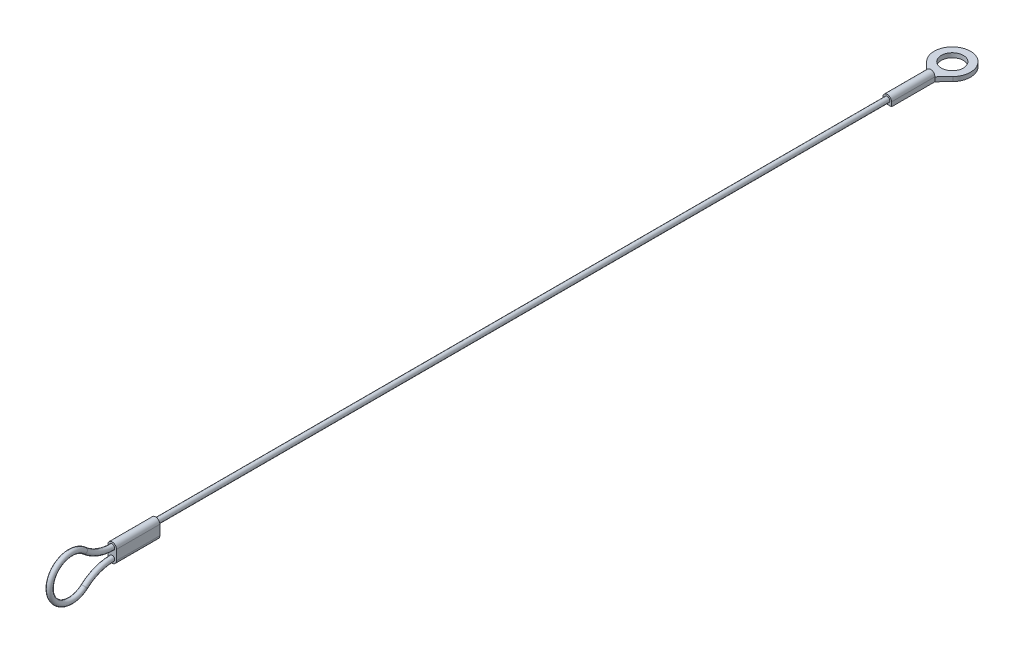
ISO-10303-21;
HEADER;
FILE_DESCRIPTION(('STEP AP214'),'2;1');
FILE_NAME('part.step','',(''),(''),'','','');
FILE_SCHEMA(('AUTOMOTIVE_DESIGN { 1 0 10303 214 1 1 1 1 }'));
ENDSEC;
DATA;
#1=APPLICATION_CONTEXT('core data for automotive mechanical design processes');
#2=APPLICATION_PROTOCOL_DEFINITION('international standard','automotive_design',2000,#1);
#3=PRODUCT_CONTEXT('',#1,'mechanical');
#4=PRODUCT('Part','Part','',(#3));
#5=PRODUCT_RELATED_PRODUCT_CATEGORY('part','',(#4));
#6=PRODUCT_DEFINITION_FORMATION('','',#4);
#7=PRODUCT_DEFINITION_CONTEXT('part definition',#1,'design');
#8=PRODUCT_DEFINITION('design','',#6,#7);
#9=PRODUCT_DEFINITION_SHAPE('','',#8);
#10=(LENGTH_UNIT() NAMED_UNIT(*) SI_UNIT(.MILLI.,.METRE.));
#11=(NAMED_UNIT(*) PLANE_ANGLE_UNIT() SI_UNIT($,.RADIAN.));
#12=(NAMED_UNIT(*) SI_UNIT($,.STERADIAN.) SOLID_ANGLE_UNIT());
#13=UNCERTAINTY_MEASURE_WITH_UNIT(LENGTH_MEASURE(1.E-05),#10,'distance_accuracy_value','');
#14=(GEOMETRIC_REPRESENTATION_CONTEXT(3) GLOBAL_UNCERTAINTY_ASSIGNED_CONTEXT((#13)) GLOBAL_UNIT_ASSIGNED_CONTEXT((#10,
#11,#12)) REPRESENTATION_CONTEXT('',''));
#15=CARTESIAN_POINT('',(0.,0.,0.));
#16=DIRECTION('',(0.,0.,1.));
#17=DIRECTION('',(1.,0.,0.));
#18=AXIS2_PLACEMENT_3D('',#15,#16,#17);
#19=CARTESIAN_POINT('',(0.,0.,-10.));
#20=DIRECTION('',(0.,0.,-1.));
#21=DIRECTION('',(-1.,0.,0.));
#22=AXIS2_PLACEMENT_3D('',#19,#20,#21);
#23=PLANE('',#22);
#24=CARTESIAN_POINT('',(0.,0.,-10.));
#25=DIRECTION('',(0.,0.,-1.));
#26=DIRECTION('',(-1.,0.,0.));
#27=AXIS2_PLACEMENT_3D('',#24,#25,#26);
#28=CIRCLE('',#27,0.995);
#29=CARTESIAN_POINT('',(-0.995,0.00749999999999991,-10.));
#30=VERTEX_POINT('',#29);
#31=CARTESIAN_POINT('',(0.995,0.00749999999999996,-10.));
#32=VERTEX_POINT('',#31);
#33=EDGE_CURVE('E177',#30,#32,#28,.T.);
#34=ORIENTED_EDGE('',*,*,#33,.T.);
#35=DIRECTION('',(-1.,0.,0.));
#36=VECTOR('',#35,1.);
#37=CARTESIAN_POINT('',(-0.995,0.015,-10.));
#38=LINE('',#37,#36);
#39=EDGE_CURVE('E135',#32,#30,#38,.T.);
#40=ORIENTED_EDGE('',*,*,#39,.T.);
#41=EDGE_LOOP('',(#34,#40));
#42=FACE_BOUND('',#41,.T.);
#43=ADVANCED_FACE('F39',(#42),#23,.T.);
#44=CARTESIAN_POINT('',(0.,0.,178.6));
#45=DIRECTION('',(0.,0.,-1.));
#46=DIRECTION('',(-1.,0.,0.));
#47=AXIS2_PLACEMENT_3D('',#44,#45,#46);
#48=CYLINDRICAL_SURFACE('',#47,0.595);
#49=CARTESIAN_POINT('',(0.,0.,168.6));
#50=DIRECTION('',(0.,0.,-1.));
#51=DIRECTION('',(0.,1.,0.));
#52=AXIS2_PLACEMENT_3D('',#49,#50,#51);
#53=CIRCLE('',#52,0.595);
#54=CARTESIAN_POINT('',(0.,0.595,168.6));
#55=VERTEX_POINT('',#54);
#56=EDGE_CURVE('E223',#55,#55,#53,.T.);
#57=ORIENTED_EDGE('',*,*,#56,.T.);
#58=EDGE_LOOP('',(#57));
#59=FACE_BOUND('',#58,.T.);
#60=CARTESIAN_POINT('',(0.,0.,0.));
#61=DIRECTION('',(0.,0.,1.));
#62=DIRECTION('',(1.,0.,0.));
#63=AXIS2_PLACEMENT_3D('',#60,#61,#62);
#64=CIRCLE('',#63,0.595);
#65=CARTESIAN_POINT('',(0.595,0.,0.));
#66=VERTEX_POINT('',#65);
#67=EDGE_CURVE('E200',#66,#66,#64,.T.);
#68=ORIENTED_EDGE('',*,*,#67,.T.);
#69=EDGE_LOOP('',(#68));
#70=FACE_BOUND('',#69,.T.);
#71=ADVANCED_FACE('F41',(#59,#70),#48,.T.);
#72=CARTESIAN_POINT('',(0.,2.43728648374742E-13,168.6));
#73=DIRECTION('',(0.,0.,1.));
#74=DIRECTION('',(0.,-1.,0.));
#75=AXIS2_PLACEMENT_3D('',#72,#73,#74);
#76=CYLINDRICAL_SURFACE('',#75,0.995);
#77=CARTESIAN_POINT('',(0.,2.58184677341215E-13,178.6));
#78=DIRECTION('',(0.,0.,-1.));
#79=DIRECTION('',(0.,1.,0.));
#80=AXIS2_PLACEMENT_3D('',#77,#78,#79);
#81=CIRCLE('',#80,0.995);
#82=CARTESIAN_POINT('',(-0.995,2.5830652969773E-13,178.6));
#83=VERTEX_POINT('',#82);
#84=CARTESIAN_POINT('',(0.995,2.580628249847E-13,178.6));
#85=VERTEX_POINT('',#84);
#86=EDGE_CURVE('E195',#83,#85,#81,.T.);
#87=ORIENTED_EDGE('',*,*,#86,.T.);
#88=DIRECTION('',(0.,0.,1.));
#89=VECTOR('',#88,1.);
#90=CARTESIAN_POINT('',(0.995,2.43606796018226E-13,168.6));
#91=LINE('',#90,#89);
#92=CARTESIAN_POINT('',(0.995,2.43606796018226E-13,168.6));
#93=VERTEX_POINT('',#92);
#94=EDGE_CURVE('E216',#93,#85,#91,.T.);
#95=ORIENTED_EDGE('',*,*,#94,.F.);
#96=CARTESIAN_POINT('',(0.,2.43728648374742E-13,168.6));
#97=DIRECTION('',(0.,0.,-1.));
#98=DIRECTION('',(0.,1.,0.));
#99=AXIS2_PLACEMENT_3D('',#96,#97,#98);
#100=CIRCLE('',#99,0.995);
#101=CARTESIAN_POINT('',(-0.995,2.43850500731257E-13,168.6));
#102=VERTEX_POINT('',#101);
#103=EDGE_CURVE('E184',#102,#93,#100,.T.);
#104=ORIENTED_EDGE('',*,*,#103,.F.);
#105=DIRECTION('',(0.,0.,1.));
#106=VECTOR('',#105,1.);
#107=CARTESIAN_POINT('',(-0.995,2.43850500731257E-13,168.6));
#108=LINE('',#107,#106);
#109=EDGE_CURVE('E194',#102,#83,#108,.T.);
#110=ORIENTED_EDGE('',*,*,#109,.T.);
#111=EDGE_LOOP('',(#87,#95,#104,#110));
#112=FACE_BOUND('',#111,.T.);
#113=ADVANCED_FACE('F418',(#112),#76,.T.);
#114=CARTESIAN_POINT('',(0.995,2.43606796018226E-13,168.6));
#115=DIRECTION('',(-1.,0.,0.));
#116=DIRECTION('',(0.,-1.,0.));
#117=AXIS2_PLACEMENT_3D('',#114,#115,#116);
#118=PLANE('',#117);
#119=DIRECTION('',(0.,-1.,0.));
#120=VECTOR('',#119,1.);
#121=CARTESIAN_POINT('',(0.995,2.580628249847E-13,178.6));
#122=LINE('',#121,#120);
#123=CARTESIAN_POINT('',(0.994999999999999,-2.26625258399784,178.6));
#124=VERTEX_POINT('',#123);
#125=EDGE_CURVE('E199',#85,#124,#122,.T.);
#126=ORIENTED_EDGE('',*,*,#125,.T.);
#127=DIRECTION('',(0.,0.,1.));
#128=VECTOR('',#127,1.);
#129=CARTESIAN_POINT('',(0.994999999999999,-2.26625258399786,168.6));
#130=LINE('',#129,#128);
#131=CARTESIAN_POINT('',(0.994999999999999,-2.26625258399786,168.6));
#132=VERTEX_POINT('',#131);
#133=EDGE_CURVE('E212',#132,#124,#130,.T.);
#134=ORIENTED_EDGE('',*,*,#133,.F.);
#135=DIRECTION('',(0.,-1.,0.));
#136=VECTOR('',#135,1.);
#137=CARTESIAN_POINT('',(0.995,2.43606796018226E-13,168.6));
#138=LINE('',#137,#136);
#139=EDGE_CURVE('E87',#93,#132,#138,.T.);
#140=ORIENTED_EDGE('',*,*,#139,.F.);
#141=ORIENTED_EDGE('',*,*,#94,.T.);
#142=EDGE_LOOP('',(#126,#134,#140,#141));
#143=FACE_BOUND('',#142,.T.);
#144=ADVANCED_FACE('F411',(#143),#118,.F.);
#145=CARTESIAN_POINT('',(0.,-2.26625258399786,168.6));
#146=DIRECTION('',(0.,0.,1.));
#147=DIRECTION('',(0.,-1.,0.));
#148=AXIS2_PLACEMENT_3D('',#145,#146,#147);
#149=CYLINDRICAL_SURFACE('',#148,0.995);
#150=CARTESIAN_POINT('',(0.,-2.26625258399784,178.6));
#151=DIRECTION('',(0.,0.,-1.));
#152=DIRECTION('',(0.,1.,0.));
#153=AXIS2_PLACEMENT_3D('',#150,#151,#152);
#154=CIRCLE('',#153,0.995);
#155=CARTESIAN_POINT('',(-0.995,-2.26625258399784,178.6));
#156=VERTEX_POINT('',#155);
#157=EDGE_CURVE('E203',#124,#156,#154,.T.);
#158=ORIENTED_EDGE('',*,*,#157,.T.);
#159=DIRECTION('',(0.,0.,1.));
#160=VECTOR('',#159,1.);
#161=CARTESIAN_POINT('',(-0.995,-2.26625258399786,168.6));
#162=LINE('',#161,#160);
#163=CARTESIAN_POINT('',(-0.995,-2.26625258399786,168.6));
#164=VERTEX_POINT('',#163);
#165=EDGE_CURVE('E209',#164,#156,#162,.T.);
#166=ORIENTED_EDGE('',*,*,#165,.F.);
#167=CARTESIAN_POINT('',(0.,-2.26625258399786,168.6));
#168=DIRECTION('',(0.,0.,-1.));
#169=DIRECTION('',(0.,1.,0.));
#170=AXIS2_PLACEMENT_3D('',#167,#168,#169);
#171=CIRCLE('',#170,0.995);
#172=EDGE_CURVE('E189',#132,#164,#171,.T.);
#173=ORIENTED_EDGE('',*,*,#172,.F.);
#174=ORIENTED_EDGE('',*,*,#133,.T.);
#175=EDGE_LOOP('',(#158,#166,#173,#174));
#176=FACE_BOUND('',#175,.T.);
#177=ADVANCED_FACE('F405',(#176),#149,.T.);
#178=CARTESIAN_POINT('',(-0.995,2.43850500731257E-13,168.6));
#179=DIRECTION('',(1.,0.,0.));
#180=DIRECTION('',(0.,0.,-1.));
#181=AXIS2_PLACEMENT_3D('',#178,#179,#180);
#182=PLANE('',#181);
#183=DIRECTION('',(0.,1.,0.));
#184=VECTOR('',#183,1.);
#185=CARTESIAN_POINT('',(-0.995,2.5830652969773E-13,178.6));
#186=LINE('',#185,#184);
#187=EDGE_CURVE('E79',#156,#83,#186,.T.);
#188=ORIENTED_EDGE('',*,*,#187,.T.);
#189=ORIENTED_EDGE('',*,*,#109,.F.);
#190=DIRECTION('',(0.,1.,0.));
#191=VECTOR('',#190,1.);
#192=CARTESIAN_POINT('',(-0.995,2.43850500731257E-13,168.6));
#193=LINE('',#192,#191);
#194=EDGE_CURVE('E59',#164,#102,#193,.T.);
#195=ORIENTED_EDGE('',*,*,#194,.F.);
#196=ORIENTED_EDGE('',*,*,#165,.T.);
#197=EDGE_LOOP('',(#188,#189,#195,#196));
#198=FACE_BOUND('',#197,.T.);
#199=ADVANCED_FACE('F399',(#198),#182,.F.);
#200=CARTESIAN_POINT('',(0.,2.43728648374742E-13,168.6));
#201=DIRECTION('',(0.,0.,-1.));
#202=DIRECTION('',(0.,1.,0.));
#203=AXIS2_PLACEMENT_3D('',#200,#201,#202);
#204=PLANE('',#203);
#205=ORIENTED_EDGE('',*,*,#56,.F.);
#206=EDGE_LOOP('',(#205));
#207=FACE_BOUND('',#206,.T.);
#208=ORIENTED_EDGE('',*,*,#103,.T.);
#209=ORIENTED_EDGE('',*,*,#139,.T.);
#210=ORIENTED_EDGE('',*,*,#172,.T.);
#211=ORIENTED_EDGE('',*,*,#194,.T.);
#212=EDGE_LOOP('',(#208,#209,#210,#211));
#213=FACE_BOUND('',#212,.T.);
#214=ADVANCED_FACE('F277',(#207,#213),#204,.T.);
#215=CARTESIAN_POINT('',(0.,2.58184677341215E-13,178.6));
#216=DIRECTION('',(0.,0.,-1.));
#217=DIRECTION('',(0.,1.,0.));
#218=AXIS2_PLACEMENT_3D('',#215,#216,#217);
#219=PLANE('',#218);
#220=CARTESIAN_POINT('',(0.,-2.26625258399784,178.6));
#221=DIRECTION('',(0.,0.,-1.));
#222=DIRECTION('',(1.,0.,0.));
#223=AXIS2_PLACEMENT_3D('',#220,#221,#222);
#224=CIRCLE('',#223,0.595);
#225=CARTESIAN_POINT('',(0.,-1.67125258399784,178.6));
#226=VERTEX_POINT('',#225);
#227=EDGE_CURVE('E224',#226,#226,#224,.T.);
#228=ORIENTED_EDGE('',*,*,#227,.T.);
#229=EDGE_LOOP('',(#228));
#230=FACE_BOUND('',#229,.T.);
#231=CARTESIAN_POINT('',(0.,0.,178.6));
#232=DIRECTION('',(0.,0.,-1.));
#233=DIRECTION('',(0.,1.,0.));
#234=AXIS2_PLACEMENT_3D('',#231,#232,#233);
#235=CIRCLE('',#234,0.595);
#236=CARTESIAN_POINT('',(0.,-0.595000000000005,178.6));
#237=VERTEX_POINT('',#236);
#238=EDGE_CURVE('E219',#237,#237,#235,.T.);
#239=ORIENTED_EDGE('',*,*,#238,.T.);
#240=EDGE_LOOP('',(#239));
#241=FACE_BOUND('',#240,.T.);
#242=ORIENTED_EDGE('',*,*,#86,.F.);
#243=ORIENTED_EDGE('',*,*,#187,.F.);
#244=ORIENTED_EDGE('',*,*,#157,.F.);
#245=ORIENTED_EDGE('',*,*,#125,.F.);
#246=EDGE_LOOP('',(#242,#243,#244,#245));
#247=FACE_BOUND('',#246,.T.);
#248=ADVANCED_FACE('F387',(#230,#241,#247),#219,.F.);
#249=CARTESIAN_POINT('',(0.,-11.8662525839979,178.6));
#250=DIRECTION('',(1.,0.,0.));
#251=DIRECTION('',(0.,0.,-1.));
#252=AXIS2_PLACEMENT_3D('',#249,#250,#251);
#253=TOROIDAL_SURFACE('',#252,9.60000000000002,0.595);
#254=CARTESIAN_POINT('',(0.,-4.71083505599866,185.));
#255=DIRECTION('',(0.,0.666666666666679,-0.745355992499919));
#256=DIRECTION('',(1.,0.,0.));
#257=AXIS2_PLACEMENT_3D('',#254,#255,#256);
#258=CIRCLE('',#257,0.595);
#259=CARTESIAN_POINT('',(0.,-4.26734824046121,185.396666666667));
#260=VERTEX_POINT('',#259);
#261=EDGE_CURVE('E50',#260,#260,#258,.T.);
#262=CARTESIAN_POINT('',(0.,-11.8662525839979,178.6));
#263=DIRECTION('',(1.,0.,0.));
#264=DIRECTION('',(0.,0.,-1.));
#265=AXIS2_PLACEMENT_3D('',#262,#263,#264);
#266=CIRCLE('',#265,10.195);
#267=EDGE_CURVE('',#226,#260,#266,.T.);
#268=ORIENTED_EDGE('',*,*,#227,.F.);
#269=ORIENTED_EDGE('',*,*,#261,.T.);
#270=ORIENTED_EDGE('',*,*,#267,.T.);
#271=ORIENTED_EDGE('',*,*,#267,.F.);
#272=EDGE_LOOP('',(#268,#270,#269,#271));
#273=FACE_BOUND('',#272,.T.);
#274=ADVANCED_FACE('F380',(#273),#253,.T.);
#275=CARTESIAN_POINT('',(0.,-1.13312629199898,188.2));
#276=DIRECTION('',(-1.,0.,0.));
#277=DIRECTION('',(0.,0.,1.));
#278=AXIS2_PLACEMENT_3D('',#275,#276,#277);
#279=TOROIDAL_SURFACE('',#278,4.80000000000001,0.595);
#280=CARTESIAN_POINT('',(0.,2.44458247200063,185.));
#281=DIRECTION('',(0.,0.666666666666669,0.745355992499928));
#282=DIRECTION('',(1.,0.,0.));
#283=AXIS2_PLACEMENT_3D('',#280,#281,#282);
#284=CIRCLE('',#283,0.595);
#285=CARTESIAN_POINT('',(0.,2.00109565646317,185.396666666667));
#286=VERTEX_POINT('',#285);
#287=EDGE_CURVE('E11',#286,#286,#284,.T.);
#288=ORIENTED_EDGE('',*,*,#287,.T.);
#289=EDGE_LOOP('',(#288));
#290=FACE_BOUND('',#289,.T.);
#291=ORIENTED_EDGE('',*,*,#261,.F.);
#292=EDGE_LOOP('',(#291));
#293=FACE_BOUND('',#292,.T.);
#294=ADVANCED_FACE('F374',(#290,#293),#279,.T.);
#295=CARTESIAN_POINT('',(0.,9.6,178.6));
#296=DIRECTION('',(1.,0.,0.));
#297=DIRECTION('',(0.,0.,-1.));
#298=AXIS2_PLACEMENT_3D('',#295,#296,#297);
#299=TOROIDAL_SURFACE('',#298,9.6,0.595);
#300=CARTESIAN_POINT('',(0.,9.6,178.6));
#301=DIRECTION('',(1.,0.,0.));
#302=DIRECTION('',(0.,0.,-1.));
#303=AXIS2_PLACEMENT_3D('',#300,#301,#302);
#304=CIRCLE('',#303,10.195);
#305=EDGE_CURVE('',#286,#237,#304,.T.);
#306=ORIENTED_EDGE('',*,*,#287,.F.);
#307=ORIENTED_EDGE('',*,*,#238,.F.);
#308=ORIENTED_EDGE('',*,*,#305,.T.);
#309=ORIENTED_EDGE('',*,*,#305,.F.);
#310=EDGE_LOOP('',(#306,#308,#307,#309));
#311=FACE_BOUND('',#310,.T.);
#312=ADVANCED_FACE('F275',(#311),#299,.T.);
#313=CARTESIAN_POINT('',(0.,0.,-10.));
#314=DIRECTION('',(0.,0.,1.));
#315=DIRECTION('',(1.,0.,0.));
#316=AXIS2_PLACEMENT_3D('',#313,#314,#315);
#317=CYLINDRICAL_SURFACE('',#316,0.995);
#318=CARTESIAN_POINT('',(0.,0.,0.));
#319=DIRECTION('',(0.,0.,-1.));
#320=DIRECTION('',(-1.,0.,0.));
#321=AXIS2_PLACEMENT_3D('',#318,#319,#320);
#322=CIRCLE('',#321,0.995);
#323=CARTESIAN_POINT('',(-0.995,0.,0.));
#324=VERTEX_POINT('',#323);
#325=CARTESIAN_POINT('',(0.995,0.,0.));
#326=VERTEX_POINT('',#325);
#327=EDGE_CURVE('E164',#324,#326,#322,.T.);
#328=ORIENTED_EDGE('',*,*,#327,.T.);
#329=DIRECTION('',(0.,0.,1.));
#330=VECTOR('',#329,1.);
#331=CARTESIAN_POINT('',(0.995,0.,-10.));
#332=LINE('',#331,#330);
#333=EDGE_CURVE('E234',#32,#326,#332,.T.);
#334=ORIENTED_EDGE('',*,*,#333,.F.);
#335=ORIENTED_EDGE('',*,*,#33,.F.);
#336=DIRECTION('',(0.,0.,1.));
#337=VECTOR('',#336,1.);
#338=CARTESIAN_POINT('',(-0.995,0.,-10.));
#339=LINE('',#338,#337);
#340=EDGE_CURVE('E183',#30,#324,#339,.T.);
#341=ORIENTED_EDGE('',*,*,#340,.T.);
#342=EDGE_LOOP('',(#328,#334,#335,#341));
#343=FACE_BOUND('',#342,.T.);
#344=ADVANCED_FACE('F270',(#343),#317,.T.);
#345=CARTESIAN_POINT('',(0.995,0.,-10.));
#346=DIRECTION('',(-1.,0.,0.));
#347=DIRECTION('',(0.,-1.,0.));
#348=AXIS2_PLACEMENT_3D('',#345,#346,#347);
#349=PLANE('',#348);
#350=DIRECTION('',(0.,-1.,0.));
#351=VECTOR('',#350,1.);
#352=CARTESIAN_POINT('',(0.995,0.,0.));
#353=LINE('',#352,#351);
#354=CARTESIAN_POINT('',(0.995,-0.995,0.));
#355=VERTEX_POINT('',#354);
#356=EDGE_CURVE('E167',#326,#355,#353,.T.);
#357=ORIENTED_EDGE('',*,*,#356,.T.);
#358=DIRECTION('',(0.,0.,1.));
#359=VECTOR('',#358,1.);
#360=CARTESIAN_POINT('',(0.995,-0.995,-10.));
#361=LINE('',#360,#359);
#362=CARTESIAN_POINT('',(0.995,-0.995,-10.));
#363=VERTEX_POINT('',#362);
#364=EDGE_CURVE('E182',#363,#355,#361,.T.);
#365=ORIENTED_EDGE('',*,*,#364,.F.);
#366=DIRECTION('',(0.,-1.,0.));
#367=VECTOR('',#366,1.);
#368=CARTESIAN_POINT('',(0.995,0.,-10.));
#369=LINE('',#368,#367);
#370=EDGE_CURVE('E246',#32,#363,#369,.T.);
#371=ORIENTED_EDGE('',*,*,#370,.F.);
#372=ORIENTED_EDGE('',*,*,#333,.T.);
#373=EDGE_LOOP('',(#357,#365,#371,#372));
#374=FACE_BOUND('',#373,.T.);
#375=ADVANCED_FACE('F259',(#374),#349,.F.);
#376=CARTESIAN_POINT('',(0.,-0.995,-10.));
#377=DIRECTION('',(0.,1.,0.));
#378=DIRECTION('',(0.,0.,1.));
#379=AXIS2_PLACEMENT_3D('',#376,#377,#378);
#380=PLANE('',#379);
#381=DIRECTION('',(-1.,0.,0.));
#382=VECTOR('',#381,1.);
#383=CARTESIAN_POINT('',(0.,-0.995,0.));
#384=LINE('',#383,#382);
#385=CARTESIAN_POINT('',(-0.995,-0.995,0.));
#386=VERTEX_POINT('',#385);
#387=EDGE_CURVE('E171',#355,#386,#384,.T.);
#388=ORIENTED_EDGE('',*,*,#387,.T.);
#389=DIRECTION('',(0.,0.,1.));
#390=VECTOR('',#389,1.);
#391=CARTESIAN_POINT('',(-0.995,-0.995,-10.));
#392=LINE('',#391,#390);
#393=CARTESIAN_POINT('',(-0.995,-0.995,-10.));
#394=VERTEX_POINT('',#393);
#395=EDGE_CURVE('E178',#394,#386,#392,.T.);
#396=ORIENTED_EDGE('',*,*,#395,.F.);
#397=DIRECTION('',(-0.69489731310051,0.,-0.719108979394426));
#398=VECTOR('',#397,1.);
#399=CARTESIAN_POINT('',(-3.01306662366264,-0.995,-12.0883802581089));
#400=LINE('',#399,#398);
#401=CARTESIAN_POINT('',(-3.01306662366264,-0.995,-12.0883802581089));
#402=VERTEX_POINT('',#401);
#403=EDGE_CURVE('E513',#394,#402,#400,.T.);
#404=ORIENTED_EDGE('',*,*,#403,.T.);
#405=CARTESIAN_POINT('',(0.,-0.995,-15.));
#406=DIRECTION('',(0.,-1.,0.));
#407=DIRECTION('',(0.,0.,1.));
#408=AXIS2_PLACEMENT_3D('',#405,#406,#407);
#409=CIRCLE('',#408,4.19);
#410=CARTESIAN_POINT('',(3.01306662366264,-0.995,-12.0883802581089));
#411=VERTEX_POINT('',#410);
#412=EDGE_CURVE('E129',#402,#411,#409,.T.);
#413=ORIENTED_EDGE('',*,*,#412,.T.);
#414=DIRECTION('',(-0.69489731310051,0.,0.719108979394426));
#415=VECTOR('',#414,1.);
#416=CARTESIAN_POINT('',(0.995,-0.995,-10.));
#417=LINE('',#416,#415);
#418=EDGE_CURVE('E152',#411,#363,#417,.T.);
#419=ORIENTED_EDGE('',*,*,#418,.T.);
#420=ORIENTED_EDGE('',*,*,#364,.T.);
#421=EDGE_LOOP('',(#388,#396,#404,#413,#419,#420));
#422=FACE_BOUND('',#421,.T.);
#423=CARTESIAN_POINT('',(0.,-0.995,-15.));
#424=DIRECTION('',(0.,-1.,0.));
#425=DIRECTION('',(0.,0.,-1.));
#426=AXIS2_PLACEMENT_3D('',#423,#424,#425);
#427=CIRCLE('',#426,2.54);
#428=CARTESIAN_POINT('',(0.,-0.995,-17.54));
#429=VERTEX_POINT('',#428);
#430=EDGE_CURVE('E509',#429,#429,#427,.T.);
#431=ORIENTED_EDGE('',*,*,#430,.F.);
#432=EDGE_LOOP('',(#431));
#433=FACE_BOUND('',#432,.T.);
#434=ADVANCED_FACE('F269',(#422,#433),#380,.F.);
#435=CARTESIAN_POINT('',(-0.995,-0.995,-10.));
#436=DIRECTION('',(1.,0.,0.));
#437=DIRECTION('',(0.,1.,0.));
#438=AXIS2_PLACEMENT_3D('',#435,#436,#437);
#439=PLANE('',#438);
#440=DIRECTION('',(0.,1.,0.));
#441=VECTOR('',#440,1.);
#442=CARTESIAN_POINT('',(-0.995,-0.995,0.));
#443=LINE('',#442,#441);
#444=EDGE_CURVE('E174',#386,#324,#443,.T.);
#445=ORIENTED_EDGE('',*,*,#444,.T.);
#446=ORIENTED_EDGE('',*,*,#340,.F.);
#447=DIRECTION('',(0.,1.,0.));
#448=VECTOR('',#447,1.);
#449=CARTESIAN_POINT('',(-0.995,-0.995,-10.));
#450=LINE('',#449,#448);
#451=EDGE_CURVE('E149',#394,#30,#450,.T.);
#452=ORIENTED_EDGE('',*,*,#451,.F.);
#453=ORIENTED_EDGE('',*,*,#395,.T.);
#454=EDGE_LOOP('',(#445,#446,#452,#453));
#455=FACE_BOUND('',#454,.T.);
#456=ADVANCED_FACE('F313',(#455),#439,.F.);
#457=CARTESIAN_POINT('',(0.,0.,0.));
#458=DIRECTION('',(0.,0.,-1.));
#459=DIRECTION('',(-1.,0.,0.));
#460=AXIS2_PLACEMENT_3D('',#457,#458,#459);
#461=PLANE('',#460);
#462=ORIENTED_EDGE('',*,*,#67,.F.);
#463=EDGE_LOOP('',(#462));
#464=FACE_BOUND('',#463,.T.);
#465=ORIENTED_EDGE('',*,*,#327,.F.);
#466=ORIENTED_EDGE('',*,*,#444,.F.);
#467=ORIENTED_EDGE('',*,*,#387,.F.);
#468=ORIENTED_EDGE('',*,*,#356,.F.);
#469=EDGE_LOOP('',(#465,#466,#467,#468));
#470=FACE_BOUND('',#469,.T.);
#471=ADVANCED_FACE('F309',(#464,#470),#461,.F.);
#472=CARTESIAN_POINT('',(-3.01306662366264,0.015,-12.0883802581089));
#473=DIRECTION('',(-0.719108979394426,0.,0.69489731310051));
#474=DIRECTION('',(0.69489731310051,0.,0.719108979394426));
#475=AXIS2_PLACEMENT_3D('',#472,#473,#474);
#476=PLANE('',#475);
#477=ORIENTED_EDGE('',*,*,#403,.F.);
#478=ORIENTED_EDGE('',*,*,#451,.T.);
#479=DIRECTION('',(-0.69489731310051,0.,-0.719108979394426));
#480=VECTOR('',#479,1.);
#481=CARTESIAN_POINT('',(-3.01306662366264,0.015,-12.0883802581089));
#482=LINE('',#481,#480);
#483=CARTESIAN_POINT('',(-3.01306662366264,0.015,-12.0883802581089));
#484=VERTEX_POINT('',#483);
#485=EDGE_CURVE('E142',#30,#484,#482,.T.);
#486=ORIENTED_EDGE('',*,*,#485,.T.);
#487=DIRECTION('',(0.,-1.,0.));
#488=VECTOR('',#487,1.);
#489=CARTESIAN_POINT('',(-3.01306662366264,0.015,-12.0883802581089));
#490=LINE('',#489,#488);
#491=EDGE_CURVE('E124',#484,#402,#490,.T.);
#492=ORIENTED_EDGE('',*,*,#491,.T.);
#493=EDGE_LOOP('',(#477,#478,#486,#492));
#494=FACE_BOUND('',#493,.T.);
#495=ADVANCED_FACE('F147',(#494),#476,.T.);
#496=CARTESIAN_POINT('',(0.995,0.015,-10.));
#497=DIRECTION('',(0.719108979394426,0.,0.69489731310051));
#498=DIRECTION('',(0.69489731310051,0.,-0.719108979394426));
#499=AXIS2_PLACEMENT_3D('',#496,#497,#498);
#500=PLANE('',#499);
#501=ORIENTED_EDGE('',*,*,#418,.F.);
#502=DIRECTION('',(0.,-1.,0.));
#503=VECTOR('',#502,1.);
#504=CARTESIAN_POINT('',(3.01306662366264,0.015,-12.0883802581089));
#505=LINE('',#504,#503);
#506=CARTESIAN_POINT('',(3.01306662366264,0.015,-12.0883802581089));
#507=VERTEX_POINT('',#506);
#508=EDGE_CURVE('E134',#507,#411,#505,.T.);
#509=ORIENTED_EDGE('',*,*,#508,.F.);
#510=DIRECTION('',(-0.69489731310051,0.,0.719108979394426));
#511=VECTOR('',#510,1.);
#512=CARTESIAN_POINT('',(0.995,0.015,-10.));
#513=LINE('',#512,#511);
#514=EDGE_CURVE('E144',#507,#32,#513,.T.);
#515=ORIENTED_EDGE('',*,*,#514,.T.);
#516=ORIENTED_EDGE('',*,*,#370,.T.);
#517=EDGE_LOOP('',(#501,#509,#515,#516));
#518=FACE_BOUND('',#517,.T.);
#519=ADVANCED_FACE('F329',(#518),#500,.T.);
#520=CARTESIAN_POINT('',(0.,0.015,-15.));
#521=DIRECTION('',(0.,-1.,0.));
#522=DIRECTION('',(0.,0.,-1.));
#523=AXIS2_PLACEMENT_3D('',#520,#521,#522);
#524=CYLINDRICAL_SURFACE('',#523,4.19);
#525=ORIENTED_EDGE('',*,*,#412,.F.);
#526=ORIENTED_EDGE('',*,*,#491,.F.);
#527=CARTESIAN_POINT('',(0.,0.015,-15.));
#528=DIRECTION('',(0.,-1.,0.));
#529=DIRECTION('',(0.,0.,1.));
#530=AXIS2_PLACEMENT_3D('',#527,#528,#529);
#531=CIRCLE('',#530,4.19);
#532=EDGE_CURVE('E127',#484,#507,#531,.T.);
#533=ORIENTED_EDGE('',*,*,#532,.T.);
#534=ORIENTED_EDGE('',*,*,#508,.T.);
#535=EDGE_LOOP('',(#525,#526,#533,#534));
#536=FACE_BOUND('',#535,.T.);
#537=ADVANCED_FACE('F126',(#536),#524,.T.);
#538=CARTESIAN_POINT('',(0.,0.015,-15.));
#539=DIRECTION('',(0.,1.,0.));
#540=DIRECTION('',(0.,0.,1.));
#541=AXIS2_PLACEMENT_3D('',#538,#539,#540);
#542=PLANE('',#541);
#543=CARTESIAN_POINT('',(0.,0.015,-15.));
#544=DIRECTION('',(0.,-1.,0.));
#545=DIRECTION('',(0.,0.,-1.));
#546=AXIS2_PLACEMENT_3D('',#543,#544,#545);
#547=CIRCLE('',#546,2.54);
#548=CARTESIAN_POINT('',(0.,0.015,-17.54));
#549=VERTEX_POINT('',#548);
#550=EDGE_CURVE('E506',#549,#549,#547,.T.);
#551=ORIENTED_EDGE('',*,*,#550,.T.);
#552=EDGE_LOOP('',(#551));
#553=FACE_BOUND('',#552,.T.);
#554=ORIENTED_EDGE('',*,*,#485,.F.);
#555=ORIENTED_EDGE('',*,*,#39,.F.);
#556=ORIENTED_EDGE('',*,*,#514,.F.);
#557=ORIENTED_EDGE('',*,*,#532,.F.);
#558=EDGE_LOOP('',(#554,#555,#556,#557));
#559=FACE_BOUND('',#558,.T.);
#560=ADVANCED_FACE('F140',(#553,#559),#542,.T.);
#561=CARTESIAN_POINT('',(0.,0.015,-15.));
#562=DIRECTION('',(0.,-1.,0.));
#563=DIRECTION('',(0.,0.,-1.));
#564=AXIS2_PLACEMENT_3D('',#561,#562,#563);
#565=CYLINDRICAL_SURFACE('',#564,2.54);
#566=ORIENTED_EDGE('',*,*,#550,.F.);
#567=EDGE_LOOP('',(#566));
#568=FACE_BOUND('',#567,.T.);
#569=ORIENTED_EDGE('',*,*,#430,.T.);
#570=EDGE_LOOP('',(#569));
#571=FACE_BOUND('',#570,.T.);
#572=ADVANCED_FACE('F486',(#568,#571),#565,.F.);
#573=CLOSED_SHELL('',(#43,#71,#113,#144,#177,#199,#214,#248,#274,#294,#312,#344,#375,#434,#456,
#471,#495,#519,#537,#560,#572));
#574=MANIFOLD_SOLID_BREP('B2',#573);
#575=ADVANCED_BREP_SHAPE_REPRESENTATION('',(#18,#574),#14);
#576=SHAPE_DEFINITION_REPRESENTATION(#9,#575);
ENDSEC;
END-ISO-10303-21;
